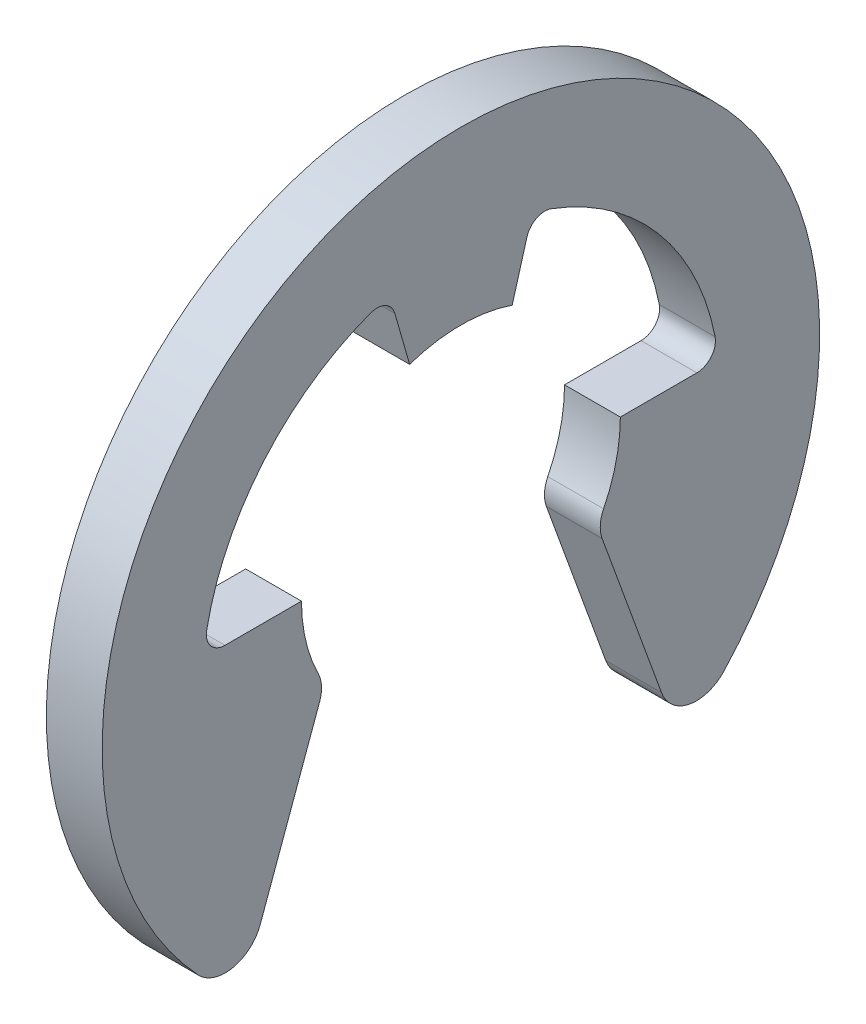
from build123d import *

# Parameters (mm, degrees)
BASE_EXTRUSION_DEPTH = 0.7


with BuildPart() as part:
    # Esquisse1 → Base-Extrusion (new body)
    with BuildSketch(Plane(origin=(0, 0, 0), x_dir=(0, 0, -1), z_dir=(1, 0, 0))):
        with BuildLine():
            Line((0.643368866, 2.243693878), (0.829014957, 2.891118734))
            ThreePointArc((0.829014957, 2.891118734), (0.948170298, 3.035106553), (1.134780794, 3.045451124))
            ThreePointArc((1.134780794, 3.045451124), (2.476591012, 2.104518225), (3.188659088, 0.628453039))
            ThreePointArc((3.188659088, 0.628453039), (3.139968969, 0.435150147), (2.959729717, 0.35))
            Line((2.959729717, 0.35), (2, 0.35))
            ThreePointArc((2, 0.35), (1.946784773, -0.10828926), (1.789970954, -0.542190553))
            ThreePointArc((1.789970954, -0.542190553), (1.748607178, -0.697974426), (1.772088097, -0.857436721))
            Line((1.772088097, -0.857436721), (2.51702962, -2.904146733))
            ThreePointArc((2.51702962, -2.904146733), (2.862993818, -3.201932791), (3.297517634, -3.062087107))
            ThreePointArc((3.297517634, -3.062087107), (0, 4.5), (-3.297517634, -3.062087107))
            ThreePointArc((-3.297517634, -3.062087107), (-2.862993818, -3.201932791), (-2.51702962, -2.904146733))
            Line((-2.51702962, -2.904146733), (-1.772088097, -0.857436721))
            ThreePointArc((-1.772088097, -0.857436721), (-1.748607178, -0.697974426), (-1.789970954, -0.542190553))
            ThreePointArc((-1.789970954, -0.542190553), (-1.946784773, -0.10828926), (-2, 0.35))
            Line((-2, 0.35), (-2.959729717, 0.35))
            ThreePointArc((-2.959729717, 0.35), (-3.139968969, 0.435150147), (-3.188659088, 0.628453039))
            ThreePointArc((-3.188659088, 0.628453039), (-2.476591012, 2.104518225), (-1.134780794, 3.045451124))
            ThreePointArc((-1.134780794, 3.045451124), (-0.948170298, 3.035106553), (-0.829014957, 2.891118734))
            Line((-0.829014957, 2.891118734), (-0.643368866, 2.243693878))
            ThreePointArc((-0.643368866, 2.243693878), (0, 2.35), (0.643368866, 2.243693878))
        make_face()
    extrude(amount=BASE_EXTRUSION_DEPTH)


solid = part.part
